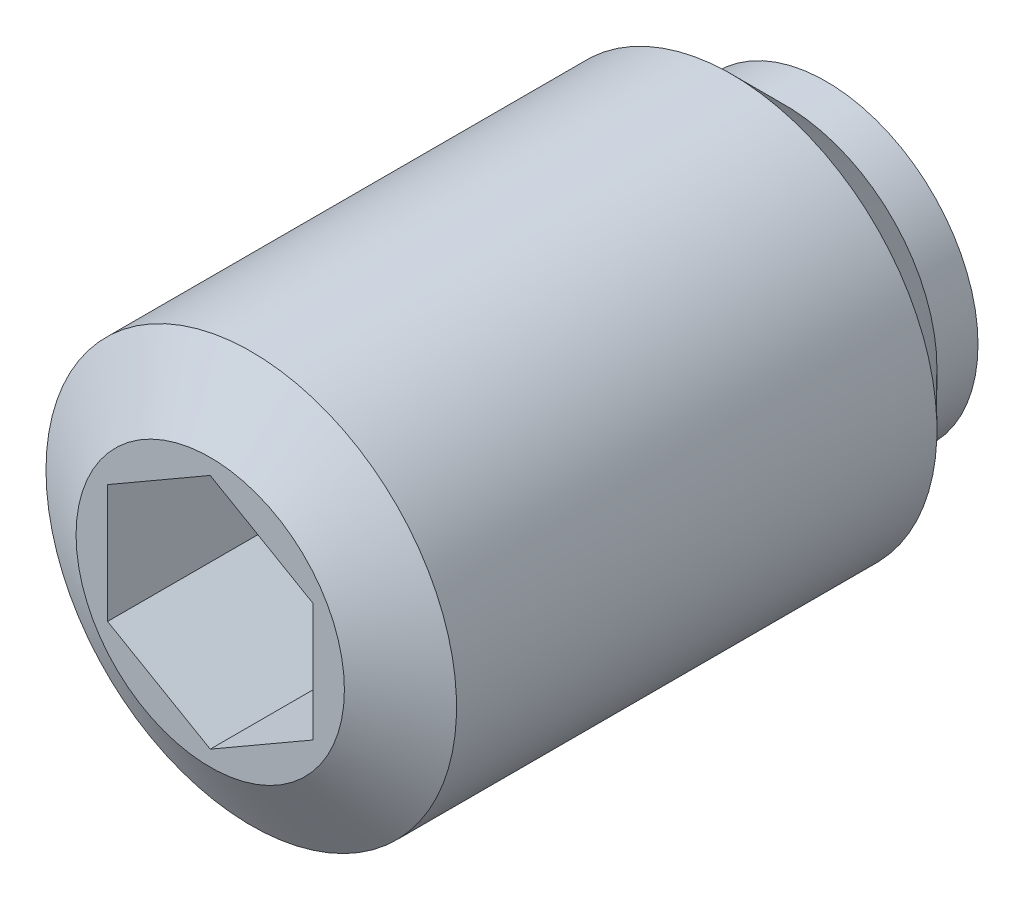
ISO-10303-21;
HEADER;
FILE_DESCRIPTION(('STEP AP214'),'2;1');
FILE_NAME('part.step','',(''),(''),'','','');
FILE_SCHEMA(('AUTOMOTIVE_DESIGN { 1 0 10303 214 1 1 1 1 }'));
ENDSEC;
DATA;
#1=APPLICATION_CONTEXT('core data for automotive mechanical design processes');
#2=APPLICATION_PROTOCOL_DEFINITION('international standard','automotive_design',2000,#1);
#3=PRODUCT_CONTEXT('',#1,'mechanical');
#4=PRODUCT('Part','Part','',(#3));
#5=PRODUCT_RELATED_PRODUCT_CATEGORY('part','',(#4));
#6=PRODUCT_DEFINITION_FORMATION('','',#4);
#7=PRODUCT_DEFINITION_CONTEXT('part definition',#1,'design');
#8=PRODUCT_DEFINITION('design','',#6,#7);
#9=PRODUCT_DEFINITION_SHAPE('','',#8);
#10=(LENGTH_UNIT() NAMED_UNIT(*) SI_UNIT(.MILLI.,.METRE.));
#11=(NAMED_UNIT(*) PLANE_ANGLE_UNIT() SI_UNIT($,.RADIAN.));
#12=(NAMED_UNIT(*) SI_UNIT($,.STERADIAN.) SOLID_ANGLE_UNIT());
#13=UNCERTAINTY_MEASURE_WITH_UNIT(LENGTH_MEASURE(1.E-05),#10,'distance_accuracy_value','');
#14=(GEOMETRIC_REPRESENTATION_CONTEXT(3) GLOBAL_UNCERTAINTY_ASSIGNED_CONTEXT((#13)) GLOBAL_UNIT_ASSIGNED_CONTEXT((#10,
#11,#12)) REPRESENTATION_CONTEXT('',''));
#15=CARTESIAN_POINT('',(0.,0.,0.));
#16=DIRECTION('',(0.,0.,1.));
#17=DIRECTION('',(1.,0.,0.));
#18=AXIS2_PLACEMENT_3D('',#15,#16,#17);
#19=CARTESIAN_POINT('',(0.,1.01980390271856,0.));
#20=DIRECTION('',(0.,0.,1.));
#21=DIRECTION('',(-1.,0.,0.));
#22=AXIS2_PLACEMENT_3D('',#19,#20,#21);
#23=PLANE('',#22);
#24=CARTESIAN_POINT('',(0.,0.,0.));
#25=DIRECTION('',(0.,0.,1.));
#26=DIRECTION('',(-1.,0.,0.));
#27=AXIS2_PLACEMENT_3D('',#24,#25,#26);
#28=CIRCLE('',#27,1.01980390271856);
#29=CARTESIAN_POINT('',(0.,1.01980390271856,0.));
#30=VERTEX_POINT('',#29);
#31=EDGE_CURVE('E9',#30,#30,#28,.T.);
#32=ORIENTED_EDGE('',*,*,#31,.F.);
#33=EDGE_LOOP('',(#32));
#34=FACE_BOUND('',#33,.T.);
#35=ADVANCED_FACE('F14',(#34),#23,.F.);
#36=CARTESIAN_POINT('',(0.,0.,1.1));
#37=DIRECTION('',(0.,0.,1.));
#38=DIRECTION('',(0.,1.,0.));
#39=AXIS2_PLACEMENT_3D('',#36,#37,#38);
#40=SPHERICAL_SURFACE('',#39,1.5);
#41=CARTESIAN_POINT('',(0.,0.,0.3));
#42=DIRECTION('',(0.,0.,1.));
#43=DIRECTION('',(-1.,0.,0.));
#44=AXIS2_PLACEMENT_3D('',#41,#42,#43);
#45=CIRCLE('',#44,1.26885775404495);
#46=CARTESIAN_POINT('',(0.,1.26885775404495,0.3));
#47=VERTEX_POINT('',#46);
#48=EDGE_CURVE('E21',#47,#47,#45,.T.);
#49=CARTESIAN_POINT('',(0.,1.26885775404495,0.3));
#50=CARTESIAN_POINT('',(0.,1.26668545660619,0.296554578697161));
#51=CARTESIAN_POINT('',(0.,1.26449912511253,0.293118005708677));
#52=CARTESIAN_POINT('',(0.,1.26009854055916,0.286262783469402));
#53=CARTESIAN_POINT('',(0.,1.25788428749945,0.28284413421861));
#54=CARTESIAN_POINT('',(0.,1.25342800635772,0.276024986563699));
#55=CARTESIAN_POINT('',(0.,1.2511859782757,0.27262448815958));
#56=CARTESIAN_POINT('',(0.,1.24667429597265,0.265841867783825));
#57=CARTESIAN_POINT('',(0.,1.24440464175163,0.26245974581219));
#58=CARTESIAN_POINT('',(0.,1.23983785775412,0.255714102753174));
#59=CARTESIAN_POINT('',(0.,1.23754072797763,0.252350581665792));
#60=CARTESIAN_POINT('',(0.,1.23291914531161,0.245642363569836));
#61=CARTESIAN_POINT('',(0.,1.23059469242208,0.242297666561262));
#62=CARTESIAN_POINT('',(0.,1.22591861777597,0.235627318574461));
#63=CARTESIAN_POINT('',(0.,1.2235669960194,0.232301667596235));
#64=CARTESIAN_POINT('',(0.,1.21883673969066,0.225669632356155));
#65=CARTESIAN_POINT('',(0.,1.21645810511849,0.222363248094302));
#66=CARTESIAN_POINT('',(0.,1.21167398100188,0.215769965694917));
#67=CARTESIAN_POINT('',(0.,1.20926849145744,0.212483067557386));
#68=CARTESIAN_POINT('',(0.,1.20443081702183,0.205928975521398));
#69=CARTESIAN_POINT('',(0.,1.20199863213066,0.202661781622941));
#70=CARTESIAN_POINT('',(0.,1.19710772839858,0.196147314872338));
#71=CARTESIAN_POINT('',(0.,1.19464900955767,0.192900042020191));
#72=CARTESIAN_POINT('',(0.,1.18970520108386,0.186425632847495));
#73=CARTESIAN_POINT('',(0.,1.18722011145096,0.183198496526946));
#74=CARTESIAN_POINT('',(0.,1.18222372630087,0.176764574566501));
#75=CARTESIAN_POINT('',(0.,1.17971243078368,0.173557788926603));
#76=CARTESIAN_POINT('',(0.,1.17466380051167,0.167164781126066));
#77=CARTESIAN_POINT('',(0.,1.17212646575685,0.163978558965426));
#78=CARTESIAN_POINT('',(0.,1.16702592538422,0.157626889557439));
#79=CARTESIAN_POINT('',(0.,1.16446271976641,0.154461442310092));
#80=CARTESIAN_POINT('',(0.,1.15931060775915,0.148151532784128));
#81=CARTESIAN_POINT('',(0.,1.15672170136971,0.145007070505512));
#82=CARTESIAN_POINT('',(0.,1.15151835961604,0.138739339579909));
#83=CARTESIAN_POINT('',(0.,1.14890392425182,0.135616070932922));
#84=CARTESIAN_POINT('',(0.,1.14364969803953,0.129390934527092));
#85=CARTESIAN_POINT('',(0.,1.14100990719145,0.126289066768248));
#86=CARTESIAN_POINT('',(0.,1.13570514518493,0.120106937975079));
#87=CARTESIAN_POINT('',(0.,1.13304017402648,0.117026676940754));
#88=CARTESIAN_POINT('',(0.,1.12768522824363,0.1108879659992));
#89=CARTESIAN_POINT('',(0.,1.12499525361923,0.107829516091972));
#90=CARTESIAN_POINT('',(0.,1.1195904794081,0.101734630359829));
#91=CARTESIAN_POINT('',(0.,1.11687567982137,0.0986981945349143));
#92=CARTESIAN_POINT('',(0.,1.11142143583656,0.0926475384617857));
#93=CARTESIAN_POINT('',(0.,1.10868199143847,0.0896333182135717));
#94=CARTESIAN_POINT('',(0.,1.10317863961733,0.0836272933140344));
#95=CARTESIAN_POINT('',(0.,1.10041473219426,0.080635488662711));
#96=CARTESIAN_POINT('',(0.,1.09486263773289,0.0746744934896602));
#97=CARTESIAN_POINT('',(0.,1.09207445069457,0.0717053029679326));
#98=CARTESIAN_POINT('',(0.,1.08647398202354,0.0657897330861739));
#99=CARTESIAN_POINT('',(0.,1.08366170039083,0.0628433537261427));
#100=CARTESIAN_POINT('',(0.,1.07801322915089,0.0569736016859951));
#101=CARTESIAN_POINT('',(0.,1.07517703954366,0.0540502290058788));
#102=CARTESIAN_POINT('',(0.,1.06948094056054,0.0482266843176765));
#103=CARTESIAN_POINT('',(0.,1.06662103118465,0.0453265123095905));
#104=CARTESIAN_POINT('',(0.,1.06087768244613,0.0395495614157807));
#105=CARTESIAN_POINT('',(0.,1.0579942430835,0.036672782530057));
#106=CARTESIAN_POINT('',(0.,1.0522040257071,0.0309428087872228));
#107=CARTESIAN_POINT('',(0.,1.04929724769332,0.0280896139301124));
#108=CARTESIAN_POINT('',(0.,1.04346054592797,0.0224069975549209));
#109=CARTESIAN_POINT('',(0.,1.0405306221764,0.01957757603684));
#110=CARTESIAN_POINT('',(0.,1.03464782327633,0.013942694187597));
#111=CARTESIAN_POINT('',(0.,1.03169494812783,0.011137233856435));
#112=CARTESIAN_POINT('',(0.,1.02576644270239,0.00555046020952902));
#113=CARTESIAN_POINT('',(0.,1.02279081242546,0.00276914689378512));
#114=CARTESIAN_POINT('',(0.,1.01980390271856,0.));
#115=B_SPLINE_CURVE_WITH_KNOTS('',3,(#49,#50,#51,#52,#53,#54,#55,#56,#57,#58,#59,#60,#61,#62,
#63,#64,#65,#66,#67,#68,#69,#70,#71,#72,#73,#74,#75,#76,#77,#78,#79,#80,#81,#82,#83,#84,#85,#86,
#87,#88,#89,#90,#91,#92,#93,#94,#95,#96,#97,#98,#99,#100,#101,#102,#103,#104,#105,#106,#107,
#108,#109,#110,#111,#112,#113,#114),.UNSPECIFIED.,.F.,.F.,(4,2,2,2,2,2,2,2,2,2,2,2,2,2,2,2,2,2,
2,2,2,2,2,2,2,2,2,2,2,2,2,2,4),(0.,0.0122191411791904,0.0244382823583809,0.0366574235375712,
0.0488765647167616,0.061095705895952,0.0733148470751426,0.0855339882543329,0.0977531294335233,
0.109972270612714,0.122191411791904,0.134410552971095,0.146629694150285,0.158848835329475,
0.171067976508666,0.183287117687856,0.195506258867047,0.207725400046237,0.219944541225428,
0.232163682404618,0.244382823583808,0.256601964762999,0.268821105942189,0.281040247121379,
0.29325938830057,0.30547852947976,0.317697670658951,0.329916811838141,0.342135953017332,
0.354355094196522,0.366574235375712,0.378793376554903,0.391012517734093),.UNSPECIFIED.);
#116=EDGE_CURVE('BSEAM141',#47,#30,#115,.T.);
#117=ORIENTED_EDGE('',*,*,#48,.F.);
#118=ORIENTED_EDGE('',*,*,#31,.T.);
#119=ORIENTED_EDGE('',*,*,#116,.T.);
#120=ORIENTED_EDGE('',*,*,#116,.F.);
#121=EDGE_LOOP('',(#117,#119,#118,#120));
#122=FACE_BOUND('',#121,.T.);
#123=ADVANCED_FACE('F141',(#122),#40,.T.);
#124=CARTESIAN_POINT('',(0.,1.85,0.3));
#125=DIRECTION('',(0.,0.,1.));
#126=DIRECTION('',(-1.,0.,0.));
#127=AXIS2_PLACEMENT_3D('',#124,#125,#126);
#128=PLANE('',#127);
#129=CARTESIAN_POINT('',(0.,0.,0.3));
#130=DIRECTION('',(0.,0.,1.));
#131=DIRECTION('',(-1.,0.,0.));
#132=AXIS2_PLACEMENT_3D('',#129,#130,#131);
#133=CIRCLE('',#132,1.85);
#134=CARTESIAN_POINT('',(-1.85,0.,0.3));
#135=VERTEX_POINT('',#134);
#136=EDGE_CURVE('E134',#135,#135,#133,.T.);
#137=ORIENTED_EDGE('',*,*,#136,.F.);
#138=EDGE_LOOP('',(#137));
#139=FACE_BOUND('',#138,.T.);
#140=ORIENTED_EDGE('',*,*,#48,.T.);
#141=EDGE_LOOP('',(#140));
#142=FACE_BOUND('',#141,.T.);
#143=ADVANCED_FACE('F139',(#139,#142),#128,.F.);
#144=CARTESIAN_POINT('',(0.,0.,9.19507492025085));
#145=DIRECTION('',(0.,0.,1.));
#146=DIRECTION('',(-1.,0.,0.));
#147=AXIS2_PLACEMENT_3D('',#144,#145,#146);
#148=CYLINDRICAL_SURFACE('',#147,1.85);
#149=CARTESIAN_POINT('',(0.,0.,0.8));
#150=DIRECTION('',(0.,0.,1.));
#151=DIRECTION('',(-1.,0.,0.));
#152=AXIS2_PLACEMENT_3D('',#149,#150,#151);
#153=CIRCLE('',#152,1.85);
#154=CARTESIAN_POINT('',(-1.85,0.,0.8));
#155=VERTEX_POINT('',#154);
#156=EDGE_CURVE('E131',#155,#155,#153,.T.);
#157=ORIENTED_EDGE('',*,*,#156,.F.);
#158=EDGE_LOOP('',(#157));
#159=FACE_BOUND('',#158,.T.);
#160=ORIENTED_EDGE('',*,*,#136,.T.);
#161=EDGE_LOOP('',(#160));
#162=FACE_BOUND('',#161,.T.);
#163=ADVANCED_FACE('F164',(#159,#162),#148,.T.);
#164=CARTESIAN_POINT('',(0.,0.,0.8));
#165=DIRECTION('',(0.,0.,1.));
#166=DIRECTION('',(-1.,0.,0.));
#167=AXIS2_PLACEMENT_3D('',#164,#165,#166);
#168=CONICAL_SURFACE('',#167,1.85,0.78539816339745);
#169=CARTESIAN_POINT('',(0.,0.,1.45));
#170=DIRECTION('',(0.,0.,1.));
#171=DIRECTION('',(-1.,0.,0.));
#172=AXIS2_PLACEMENT_3D('',#169,#170,#171);
#173=CIRCLE('',#172,2.5);
#174=CARTESIAN_POINT('',(-2.5,0.,1.45));
#175=VERTEX_POINT('',#174);
#176=EDGE_CURVE('E128',#175,#175,#173,.T.);
#177=ORIENTED_EDGE('',*,*,#176,.F.);
#178=EDGE_LOOP('',(#177));
#179=FACE_BOUND('',#178,.T.);
#180=ORIENTED_EDGE('',*,*,#156,.T.);
#181=EDGE_LOOP('',(#180));
#182=FACE_BOUND('',#181,.T.);
#183=ADVANCED_FACE('F173',(#179,#182),#168,.T.);
#184=CARTESIAN_POINT('',(0.,0.,9.19507492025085));
#185=DIRECTION('',(0.,0.,1.));
#186=DIRECTION('',(-1.,0.,0.));
#187=AXIS2_PLACEMENT_3D('',#184,#185,#186);
#188=CYLINDRICAL_SURFACE('',#187,2.5);
#189=CARTESIAN_POINT('',(0.,0.,7.3));
#190=DIRECTION('',(0.,0.,1.));
#191=DIRECTION('',(-1.,0.,0.));
#192=AXIS2_PLACEMENT_3D('',#189,#190,#191);
#193=CIRCLE('',#192,2.5);
#194=CARTESIAN_POINT('',(-2.5,0.,7.3));
#195=VERTEX_POINT('',#194);
#196=EDGE_CURVE('E125',#195,#195,#193,.T.);
#197=ORIENTED_EDGE('',*,*,#196,.F.);
#198=EDGE_LOOP('',(#197));
#199=FACE_BOUND('',#198,.T.);
#200=ORIENTED_EDGE('',*,*,#176,.T.);
#201=EDGE_LOOP('',(#200));
#202=FACE_BOUND('',#201,.T.);
#203=ADVANCED_FACE('F182',(#199,#202),#188,.T.);
#204=CARTESIAN_POINT('',(0.,0.,7.3));
#205=DIRECTION('',(0.,0.,-1.));
#206=DIRECTION('',(1.,0.,0.));
#207=AXIS2_PLACEMENT_3D('',#204,#205,#206);
#208=CONICAL_SURFACE('',#207,2.5,1.04719755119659);
#209=CARTESIAN_POINT('',(0.,0.,7.8));
#210=DIRECTION('',(0.,0.,1.));
#211=DIRECTION('',(-1.,0.,0.));
#212=AXIS2_PLACEMENT_3D('',#209,#210,#211);
#213=CIRCLE('',#212,1.63397459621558);
#214=CARTESIAN_POINT('',(-1.63397459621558,0.,7.8));
#215=VERTEX_POINT('',#214);
#216=EDGE_CURVE('E116',#215,#215,#213,.T.);
#217=ORIENTED_EDGE('',*,*,#216,.F.);
#218=EDGE_LOOP('',(#217));
#219=FACE_BOUND('',#218,.T.);
#220=ORIENTED_EDGE('',*,*,#196,.T.);
#221=EDGE_LOOP('',(#220));
#222=FACE_BOUND('',#221,.T.);
#223=ADVANCED_FACE('F191',(#219,#222),#208,.T.);
#224=CARTESIAN_POINT('',(0.,0.,7.8));
#225=DIRECTION('',(0.,0.,-1.));
#226=DIRECTION('',(1.,0.,0.));
#227=AXIS2_PLACEMENT_3D('',#224,#225,#226);
#228=PLANE('',#227);
#229=DIRECTION('',(-0.866025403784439,-0.5,0.));
#230=VECTOR('',#229,1.);
#231=CARTESIAN_POINT('',(0.,1.44337567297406,7.8));
#232=LINE('',#231,#230);
#233=CARTESIAN_POINT('',(0.,1.44337567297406,7.8));
#234=VERTEX_POINT('',#233);
#235=CARTESIAN_POINT('',(-1.25,0.721687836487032,7.8));
#236=VERTEX_POINT('',#235);
#237=EDGE_CURVE('E82',#234,#236,#232,.T.);
#238=ORIENTED_EDGE('',*,*,#237,.F.);
#239=DIRECTION('',(-0.866025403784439,0.5,0.));
#240=VECTOR('',#239,1.);
#241=CARTESIAN_POINT('',(1.25,0.721687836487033,7.8));
#242=LINE('',#241,#240);
#243=CARTESIAN_POINT('',(1.25,0.721687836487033,7.8));
#244=VERTEX_POINT('',#243);
#245=EDGE_CURVE('E28',#244,#234,#242,.T.);
#246=ORIENTED_EDGE('',*,*,#245,.F.);
#247=DIRECTION('',(0.,1.,0.));
#248=VECTOR('',#247,1.);
#249=CARTESIAN_POINT('',(1.25,-0.721687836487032,7.8));
#250=LINE('',#249,#248);
#251=CARTESIAN_POINT('',(1.25,-0.721687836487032,7.8));
#252=VERTEX_POINT('',#251);
#253=EDGE_CURVE('E98',#252,#244,#250,.T.);
#254=ORIENTED_EDGE('',*,*,#253,.F.);
#255=DIRECTION('',(0.866025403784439,0.5,0.));
#256=VECTOR('',#255,1.);
#257=CARTESIAN_POINT('',(0.,-1.44337567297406,7.8));
#258=LINE('',#257,#256);
#259=CARTESIAN_POINT('',(0.,-1.44337567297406,7.8));
#260=VERTEX_POINT('',#259);
#261=EDGE_CURVE('E92',#260,#252,#258,.T.);
#262=ORIENTED_EDGE('',*,*,#261,.F.);
#263=DIRECTION('',(0.866025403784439,-0.5,0.));
#264=VECTOR('',#263,1.);
#265=CARTESIAN_POINT('',(-1.25,-0.721687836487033,7.8));
#266=LINE('',#265,#264);
#267=CARTESIAN_POINT('',(-1.25,-0.721687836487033,7.8));
#268=VERTEX_POINT('',#267);
#269=EDGE_CURVE('E90',#268,#260,#266,.T.);
#270=ORIENTED_EDGE('',*,*,#269,.F.);
#271=DIRECTION('',(0.,-1.,0.));
#272=VECTOR('',#271,1.);
#273=CARTESIAN_POINT('',(-1.25,0.721687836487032,7.8));
#274=LINE('',#273,#272);
#275=EDGE_CURVE('E71',#236,#268,#274,.T.);
#276=ORIENTED_EDGE('',*,*,#275,.F.);
#277=EDGE_LOOP('',(#238,#246,#254,#262,#270,#276));
#278=FACE_BOUND('',#277,.T.);
#279=ORIENTED_EDGE('',*,*,#216,.T.);
#280=EDGE_LOOP('',(#279));
#281=FACE_BOUND('',#280,.T.);
#282=ADVANCED_FACE('F86',(#278,#281),#228,.F.);
#283=CARTESIAN_POINT('',(1.25,0.721687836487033,4.8));
#284=DIRECTION('',(0.5,0.866025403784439,0.));
#285=DIRECTION('',(0.866025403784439,-0.5,0.));
#286=AXIS2_PLACEMENT_3D('',#283,#284,#285);
#287=PLANE('',#286);
#288=ORIENTED_EDGE('',*,*,#245,.T.);
#289=DIRECTION('',(0.,0.,1.));
#290=VECTOR('',#289,1.);
#291=CARTESIAN_POINT('',(0.,1.44337567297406,4.8));
#292=LINE('',#291,#290);
#293=CARTESIAN_POINT('',(0.,1.44337567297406,4.8));
#294=VERTEX_POINT('',#293);
#295=EDGE_CURVE('E79',#294,#234,#292,.T.);
#296=ORIENTED_EDGE('',*,*,#295,.F.);
#297=DIRECTION('',(-0.866025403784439,0.5,0.));
#298=VECTOR('',#297,1.);
#299=CARTESIAN_POINT('',(1.25,0.721687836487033,4.8));
#300=LINE('',#299,#298);
#301=CARTESIAN_POINT('',(1.25,0.721687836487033,4.8));
#302=VERTEX_POINT('',#301);
#303=EDGE_CURVE('E100',#302,#294,#300,.T.);
#304=ORIENTED_EDGE('',*,*,#303,.F.);
#305=DIRECTION('',(0.,0.,1.));
#306=VECTOR('',#305,1.);
#307=CARTESIAN_POINT('',(1.25,0.721687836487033,4.8));
#308=LINE('',#307,#306);
#309=EDGE_CURVE('E35',#302,#244,#308,.T.);
#310=ORIENTED_EDGE('',*,*,#309,.T.);
#311=EDGE_LOOP('',(#288,#296,#304,#310));
#312=FACE_BOUND('',#311,.T.);
#313=ADVANCED_FACE('F208',(#312),#287,.F.);
#314=CARTESIAN_POINT('',(1.25,-0.721687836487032,4.8));
#315=DIRECTION('',(1.,0.,0.));
#316=DIRECTION('',(0.,-1.,0.));
#317=AXIS2_PLACEMENT_3D('',#314,#315,#316);
#318=PLANE('',#317);
#319=ORIENTED_EDGE('',*,*,#253,.T.);
#320=ORIENTED_EDGE('',*,*,#309,.F.);
#321=DIRECTION('',(0.,1.,0.));
#322=VECTOR('',#321,1.);
#323=CARTESIAN_POINT('',(1.25,-0.721687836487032,4.8));
#324=LINE('',#323,#322);
#325=CARTESIAN_POINT('',(1.25,-0.721687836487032,4.8));
#326=VERTEX_POINT('',#325);
#327=EDGE_CURVE('E112',#326,#302,#324,.T.);
#328=ORIENTED_EDGE('',*,*,#327,.F.);
#329=DIRECTION('',(0.,0.,1.));
#330=VECTOR('',#329,1.);
#331=CARTESIAN_POINT('',(1.25,-0.721687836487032,4.8));
#332=LINE('',#331,#330);
#333=EDGE_CURVE('E117',#326,#252,#332,.T.);
#334=ORIENTED_EDGE('',*,*,#333,.T.);
#335=EDGE_LOOP('',(#319,#320,#328,#334));
#336=FACE_BOUND('',#335,.T.);
#337=ADVANCED_FACE('F216',(#336),#318,.F.);
#338=CARTESIAN_POINT('',(0.,-1.44337567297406,4.8));
#339=DIRECTION('',(0.5,-0.866025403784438,0.));
#340=DIRECTION('',(-0.866025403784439,-0.5,0.));
#341=AXIS2_PLACEMENT_3D('',#338,#339,#340);
#342=PLANE('',#341);
#343=ORIENTED_EDGE('',*,*,#261,.T.);
#344=ORIENTED_EDGE('',*,*,#333,.F.);
#345=DIRECTION('',(0.866025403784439,0.5,0.));
#346=VECTOR('',#345,1.);
#347=CARTESIAN_POINT('',(0.,-1.44337567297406,4.8));
#348=LINE('',#347,#346);
#349=CARTESIAN_POINT('',(0.,-1.44337567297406,4.8));
#350=VERTEX_POINT('',#349);
#351=EDGE_CURVE('E109',#350,#326,#348,.T.);
#352=ORIENTED_EDGE('',*,*,#351,.F.);
#353=DIRECTION('',(0.,0.,1.));
#354=VECTOR('',#353,1.);
#355=CARTESIAN_POINT('',(0.,-1.44337567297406,4.8));
#356=LINE('',#355,#354);
#357=EDGE_CURVE('E119',#350,#260,#356,.T.);
#358=ORIENTED_EDGE('',*,*,#357,.T.);
#359=EDGE_LOOP('',(#343,#344,#352,#358));
#360=FACE_BOUND('',#359,.T.);
#361=ADVANCED_FACE('F224',(#360),#342,.F.);
#362=CARTESIAN_POINT('',(-1.25,-0.721687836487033,4.8));
#363=DIRECTION('',(-0.5,-0.866025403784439,0.));
#364=DIRECTION('',(-0.866025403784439,0.5,0.));
#365=AXIS2_PLACEMENT_3D('',#362,#363,#364);
#366=PLANE('',#365);
#367=ORIENTED_EDGE('',*,*,#269,.T.);
#368=ORIENTED_EDGE('',*,*,#357,.F.);
#369=DIRECTION('',(0.866025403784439,-0.5,0.));
#370=VECTOR('',#369,1.);
#371=CARTESIAN_POINT('',(-1.25,-0.721687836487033,4.8));
#372=LINE('',#371,#370);
#373=CARTESIAN_POINT('',(-1.25,-0.721687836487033,4.8));
#374=VERTEX_POINT('',#373);
#375=EDGE_CURVE('E106',#374,#350,#372,.T.);
#376=ORIENTED_EDGE('',*,*,#375,.F.);
#377=DIRECTION('',(0.,0.,1.));
#378=VECTOR('',#377,1.);
#379=CARTESIAN_POINT('',(-1.25,-0.721687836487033,4.8));
#380=LINE('',#379,#378);
#381=EDGE_CURVE('E78',#374,#268,#380,.T.);
#382=ORIENTED_EDGE('',*,*,#381,.T.);
#383=EDGE_LOOP('',(#367,#368,#376,#382));
#384=FACE_BOUND('',#383,.T.);
#385=ADVANCED_FACE('F232',(#384),#366,.F.);
#386=CARTESIAN_POINT('',(-1.25,0.721687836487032,4.8));
#387=DIRECTION('',(-1.,0.,0.));
#388=DIRECTION('',(0.,1.,0.));
#389=AXIS2_PLACEMENT_3D('',#386,#387,#388);
#390=PLANE('',#389);
#391=ORIENTED_EDGE('',*,*,#275,.T.);
#392=ORIENTED_EDGE('',*,*,#381,.F.);
#393=DIRECTION('',(0.,-1.,0.));
#394=VECTOR('',#393,1.);
#395=CARTESIAN_POINT('',(-1.25,0.721687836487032,4.8));
#396=LINE('',#395,#394);
#397=CARTESIAN_POINT('',(-1.25,0.721687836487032,4.8));
#398=VERTEX_POINT('',#397);
#399=EDGE_CURVE('E74',#398,#374,#396,.T.);
#400=ORIENTED_EDGE('',*,*,#399,.F.);
#401=DIRECTION('',(0.,0.,1.));
#402=VECTOR('',#401,1.);
#403=CARTESIAN_POINT('',(-1.25,0.721687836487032,4.8));
#404=LINE('',#403,#402);
#405=EDGE_CURVE('E67',#398,#236,#404,.T.);
#406=ORIENTED_EDGE('',*,*,#405,.T.);
#407=EDGE_LOOP('',(#391,#392,#400,#406));
#408=FACE_BOUND('',#407,.T.);
#409=ADVANCED_FACE('F69',(#408),#390,.F.);
#410=CARTESIAN_POINT('',(0.,1.44337567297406,4.8));
#411=DIRECTION('',(-0.5,0.866025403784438,0.));
#412=DIRECTION('',(0.866025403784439,0.5,0.));
#413=AXIS2_PLACEMENT_3D('',#410,#411,#412);
#414=PLANE('',#413);
#415=ORIENTED_EDGE('',*,*,#237,.T.);
#416=ORIENTED_EDGE('',*,*,#405,.F.);
#417=DIRECTION('',(-0.866025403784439,-0.5,0.));
#418=VECTOR('',#417,1.);
#419=CARTESIAN_POINT('',(0.,1.44337567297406,4.8));
#420=LINE('',#419,#418);
#421=EDGE_CURVE('E103',#294,#398,#420,.T.);
#422=ORIENTED_EDGE('',*,*,#421,.F.);
#423=ORIENTED_EDGE('',*,*,#295,.T.);
#424=EDGE_LOOP('',(#415,#416,#422,#423));
#425=FACE_BOUND('',#424,.T.);
#426=ADVANCED_FACE('F83',(#425),#414,.F.);
#427=CARTESIAN_POINT('',(2.5,0.,4.8));
#428=DIRECTION('',(0.,0.,-1.));
#429=DIRECTION('',(1.,0.,0.));
#430=AXIS2_PLACEMENT_3D('',#427,#428,#429);
#431=PLANE('',#430);
#432=ORIENTED_EDGE('',*,*,#303,.T.);
#433=ORIENTED_EDGE('',*,*,#421,.T.);
#434=ORIENTED_EDGE('',*,*,#399,.T.);
#435=ORIENTED_EDGE('',*,*,#375,.T.);
#436=ORIENTED_EDGE('',*,*,#351,.T.);
#437=ORIENTED_EDGE('',*,*,#327,.T.);
#438=EDGE_LOOP('',(#432,#433,#434,#435,#436,#437));
#439=FACE_BOUND('',#438,.T.);
#440=ADVANCED_FACE('F256',(#439),#431,.F.);
#441=CLOSED_SHELL('',(#35,#123,#143,#163,#183,#203,#223,#282,#313,#337,#361,#385,#409,#426,#440));
#442=MANIFOLD_SOLID_BREP('B1',#441);
#443=ADVANCED_BREP_SHAPE_REPRESENTATION('',(#18,#442),#14);
#444=SHAPE_DEFINITION_REPRESENTATION(#9,#443);
ENDSEC;
END-ISO-10303-21;
